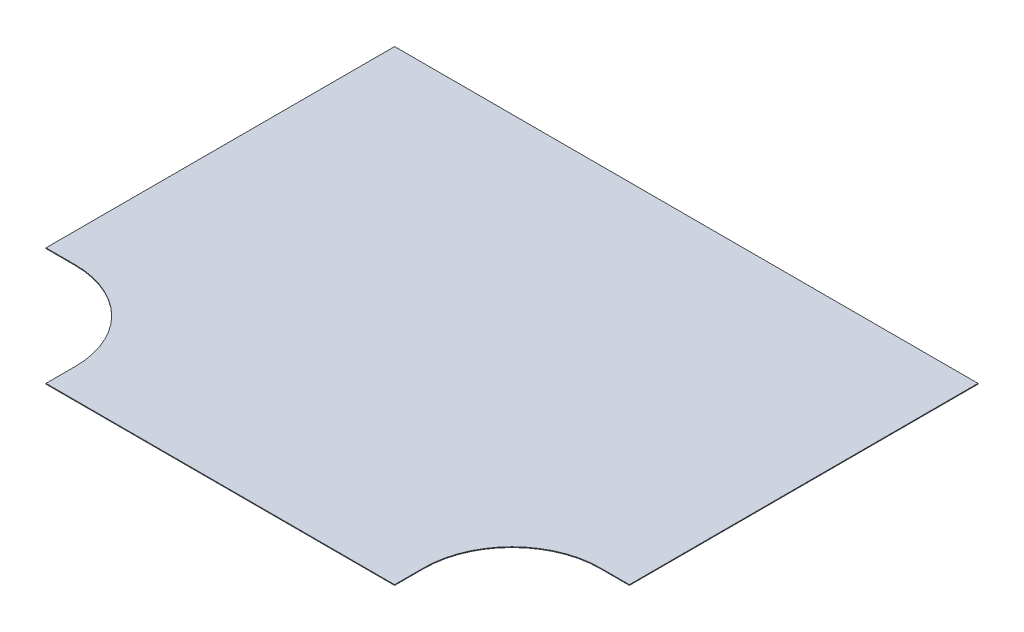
ISO-10303-21;
HEADER;
FILE_DESCRIPTION(('STEP AP214'),'2;1');
FILE_NAME('part.step','',(''),(''),'','','');
FILE_SCHEMA(('AUTOMOTIVE_DESIGN { 1 0 10303 214 1 1 1 1 }'));
ENDSEC;
DATA;
#1=APPLICATION_CONTEXT('core data for automotive mechanical design processes');
#2=APPLICATION_PROTOCOL_DEFINITION('international standard','automotive_design',2000,#1);
#3=PRODUCT_CONTEXT('',#1,'mechanical');
#4=PRODUCT('Part','Part','',(#3));
#5=PRODUCT_RELATED_PRODUCT_CATEGORY('part','',(#4));
#6=PRODUCT_DEFINITION_FORMATION('','',#4);
#7=PRODUCT_DEFINITION_CONTEXT('part definition',#1,'design');
#8=PRODUCT_DEFINITION('design','',#6,#7);
#9=PRODUCT_DEFINITION_SHAPE('','',#8);
#10=(LENGTH_UNIT() NAMED_UNIT(*) SI_UNIT(.MILLI.,.METRE.));
#11=(NAMED_UNIT(*) PLANE_ANGLE_UNIT() SI_UNIT($,.RADIAN.));
#12=(NAMED_UNIT(*) SI_UNIT($,.STERADIAN.) SOLID_ANGLE_UNIT());
#13=UNCERTAINTY_MEASURE_WITH_UNIT(LENGTH_MEASURE(1.E-05),#10,'distance_accuracy_value','');
#14=(GEOMETRIC_REPRESENTATION_CONTEXT(3) GLOBAL_UNCERTAINTY_ASSIGNED_CONTEXT((#13)) GLOBAL_UNIT_ASSIGNED_CONTEXT((#10,
#11,#12)) REPRESENTATION_CONTEXT('',''));
#15=CARTESIAN_POINT('',(0.,0.,0.));
#16=DIRECTION('',(0.,0.,1.));
#17=DIRECTION('',(1.,0.,0.));
#18=AXIS2_PLACEMENT_3D('',#15,#16,#17);
#19=CARTESIAN_POINT('',(0.,1.21412,0.));
#20=DIRECTION('',(0.,0.,-1.));
#21=DIRECTION('',(-1.,0.,0.));
#22=AXIS2_PLACEMENT_3D('',#19,#20,#21);
#23=PLANE('',#22);
#24=DIRECTION('',(1.,0.,0.));
#25=VECTOR('',#24,1.);
#26=CARTESIAN_POINT('',(0.,0.,0.));
#27=LINE('',#26,#25);
#28=CARTESIAN_POINT('',(0.,0.,0.));
#29=VERTEX_POINT('',#28);
#30=CARTESIAN_POINT('',(50.,0.,0.));
#31=VERTEX_POINT('',#30);
#32=EDGE_CURVE('E141',#29,#31,#27,.T.);
#33=ORIENTED_EDGE('',*,*,#32,.T.);
#34=DIRECTION('',(0.,-1.,0.));
#35=VECTOR('',#34,1.);
#36=CARTESIAN_POINT('',(50.,1.21412,0.));
#37=LINE('',#36,#35);
#38=CARTESIAN_POINT('',(50.,1.21412,0.));
#39=VERTEX_POINT('',#38);
#40=EDGE_CURVE('E11',#39,#31,#37,.T.);
#41=ORIENTED_EDGE('',*,*,#40,.F.);
#42=DIRECTION('',(1.,0.,0.));
#43=VECTOR('',#42,1.);
#44=CARTESIAN_POINT('',(0.,1.21412,0.));
#45=LINE('',#44,#43);
#46=CARTESIAN_POINT('',(0.,1.21412,0.));
#47=VERTEX_POINT('',#46);
#48=EDGE_CURVE('E159',#47,#39,#45,.T.);
#49=ORIENTED_EDGE('',*,*,#48,.F.);
#50=DIRECTION('',(0.,-1.,0.));
#51=VECTOR('',#50,1.);
#52=CARTESIAN_POINT('',(0.,1.21412,0.));
#53=LINE('',#52,#51);
#54=EDGE_CURVE('E137',#47,#29,#53,.T.);
#55=ORIENTED_EDGE('',*,*,#54,.T.);
#56=EDGE_LOOP('',(#33,#41,#49,#55));
#57=FACE_BOUND('',#56,.T.);
#58=ADVANCED_FACE('F33',(#57),#23,.F.);
#59=CARTESIAN_POINT('',(50.,1.21412,151.214));
#60=DIRECTION('',(0.,-1.,0.));
#61=DIRECTION('',(0.,0.,-1.));
#62=AXIS2_PLACEMENT_3D('',#59,#60,#61);
#63=CYLINDRICAL_SURFACE('',#62,151.214);
#64=CARTESIAN_POINT('',(50.,0.,151.214));
#65=DIRECTION('',(0.,-1.,0.));
#66=DIRECTION('',(0.,0.,-1.));
#67=AXIS2_PLACEMENT_3D('',#64,#65,#66);
#68=CIRCLE('',#67,151.214);
#69=CARTESIAN_POINT('',(201.214,0.,151.214));
#70=VERTEX_POINT('',#69);
#71=EDGE_CURVE('E144',#31,#70,#68,.T.);
#72=ORIENTED_EDGE('',*,*,#71,.T.);
#73=DIRECTION('',(0.,-1.,0.));
#74=VECTOR('',#73,1.);
#75=CARTESIAN_POINT('',(201.214,1.21412,151.214));
#76=LINE('',#75,#74);
#77=CARTESIAN_POINT('',(201.214,1.21412,151.214));
#78=VERTEX_POINT('',#77);
#79=EDGE_CURVE('E41',#78,#70,#76,.T.);
#80=ORIENTED_EDGE('',*,*,#79,.F.);
#81=CARTESIAN_POINT('',(50.,1.21412,151.214));
#82=DIRECTION('',(0.,-1.,0.));
#83=DIRECTION('',(0.,0.,-1.));
#84=AXIS2_PLACEMENT_3D('',#81,#82,#83);
#85=CIRCLE('',#84,151.214);
#86=EDGE_CURVE('E98',#39,#78,#85,.T.);
#87=ORIENTED_EDGE('',*,*,#86,.F.);
#88=ORIENTED_EDGE('',*,*,#40,.T.);
#89=EDGE_LOOP('',(#72,#80,#87,#88));
#90=FACE_BOUND('',#89,.T.);
#91=ADVANCED_FACE('F208',(#90),#63,.F.);
#92=CARTESIAN_POINT('',(201.214,1.21412,201.214));
#93=DIRECTION('',(1.,0.,0.));
#94=DIRECTION('',(0.,0.,-1.));
#95=AXIS2_PLACEMENT_3D('',#92,#93,#94);
#96=PLANE('',#95);
#97=DIRECTION('',(0.,0.,1.));
#98=VECTOR('',#97,1.);
#99=CARTESIAN_POINT('',(201.214,0.,201.214));
#100=LINE('',#99,#98);
#101=CARTESIAN_POINT('',(201.214,0.,201.214));
#102=VERTEX_POINT('',#101);
#103=EDGE_CURVE('E146',#70,#102,#100,.T.);
#104=ORIENTED_EDGE('',*,*,#103,.T.);
#105=DIRECTION('',(0.,-1.,0.));
#106=VECTOR('',#105,1.);
#107=CARTESIAN_POINT('',(201.214,1.21412,201.214));
#108=LINE('',#107,#106);
#109=CARTESIAN_POINT('',(201.214,1.21412,201.214));
#110=VERTEX_POINT('',#109);
#111=EDGE_CURVE('E172',#110,#102,#108,.T.);
#112=ORIENTED_EDGE('',*,*,#111,.F.);
#113=DIRECTION('',(0.,0.,1.));
#114=VECTOR('',#113,1.);
#115=CARTESIAN_POINT('',(201.214,1.21412,201.214));
#116=LINE('',#115,#114);
#117=EDGE_CURVE('E180',#78,#110,#116,.T.);
#118=ORIENTED_EDGE('',*,*,#117,.F.);
#119=ORIENTED_EDGE('',*,*,#79,.T.);
#120=EDGE_LOOP('',(#104,#112,#118,#119));
#121=FACE_BOUND('',#120,.T.);
#122=ADVANCED_FACE('F178',(#121),#96,.F.);
#123=CARTESIAN_POINT('',(201.214,1.21412,201.214));
#124=DIRECTION('',(0.,0.,-1.));
#125=DIRECTION('',(-1.,0.,0.));
#126=AXIS2_PLACEMENT_3D('',#123,#124,#125);
#127=PLANE('',#126);
#128=DIRECTION('',(1.,0.,0.));
#129=VECTOR('',#128,1.);
#130=CARTESIAN_POINT('',(201.214,0.,201.214));
#131=LINE('',#130,#129);
#132=CARTESIAN_POINT('',(798.786,0.,201.214));
#133=VERTEX_POINT('',#132);
#134=EDGE_CURVE('E148',#102,#133,#131,.T.);
#135=ORIENTED_EDGE('',*,*,#134,.T.);
#136=DIRECTION('',(0.,-1.,0.));
#137=VECTOR('',#136,1.);
#138=CARTESIAN_POINT('',(798.786,1.21412,201.214));
#139=LINE('',#138,#137);
#140=CARTESIAN_POINT('',(798.786,1.21412,201.214));
#141=VERTEX_POINT('',#140);
#142=EDGE_CURVE('E169',#141,#133,#139,.T.);
#143=ORIENTED_EDGE('',*,*,#142,.F.);
#144=DIRECTION('',(1.,0.,0.));
#145=VECTOR('',#144,1.);
#146=CARTESIAN_POINT('',(201.214,1.21412,201.214));
#147=LINE('',#146,#145);
#148=EDGE_CURVE('E198',#110,#141,#147,.T.);
#149=ORIENTED_EDGE('',*,*,#148,.F.);
#150=ORIENTED_EDGE('',*,*,#111,.T.);
#151=EDGE_LOOP('',(#135,#143,#149,#150));
#152=FACE_BOUND('',#151,.T.);
#153=ADVANCED_FACE('F189',(#152),#127,.F.);
#154=CARTESIAN_POINT('',(798.786,1.21412,201.214));
#155=DIRECTION('',(-1.,0.,0.));
#156=DIRECTION('',(0.,0.,1.));
#157=AXIS2_PLACEMENT_3D('',#154,#155,#156);
#158=PLANE('',#157);
#159=DIRECTION('',(0.,0.,-1.));
#160=VECTOR('',#159,1.);
#161=CARTESIAN_POINT('',(798.786,0.,201.214));
#162=LINE('',#161,#160);
#163=CARTESIAN_POINT('',(798.786,0.,151.214));
#164=VERTEX_POINT('',#163);
#165=EDGE_CURVE('E150',#133,#164,#162,.T.);
#166=ORIENTED_EDGE('',*,*,#165,.T.);
#167=DIRECTION('',(0.,-1.,0.));
#168=VECTOR('',#167,1.);
#169=CARTESIAN_POINT('',(798.786,1.21412,151.214));
#170=LINE('',#169,#168);
#171=CARTESIAN_POINT('',(798.786,1.21412,151.214));
#172=VERTEX_POINT('',#171);
#173=EDGE_CURVE('E166',#172,#164,#170,.T.);
#174=ORIENTED_EDGE('',*,*,#173,.F.);
#175=DIRECTION('',(0.,0.,-1.));
#176=VECTOR('',#175,1.);
#177=CARTESIAN_POINT('',(798.786,1.21412,201.214));
#178=LINE('',#177,#176);
#179=EDGE_CURVE('E195',#141,#172,#178,.T.);
#180=ORIENTED_EDGE('',*,*,#179,.F.);
#181=ORIENTED_EDGE('',*,*,#142,.T.);
#182=EDGE_LOOP('',(#166,#174,#180,#181));
#183=FACE_BOUND('',#182,.T.);
#184=ADVANCED_FACE('F193',(#183),#158,.F.);
#185=CARTESIAN_POINT('',(950.,1.21412,151.214));
#186=DIRECTION('',(0.,-1.,0.));
#187=DIRECTION('',(0.,0.,-1.));
#188=AXIS2_PLACEMENT_3D('',#185,#186,#187);
#189=CYLINDRICAL_SURFACE('',#188,151.214);
#190=CARTESIAN_POINT('',(950.,0.,151.214));
#191=DIRECTION('',(0.,-1.,0.));
#192=DIRECTION('',(0.,0.,1.));
#193=AXIS2_PLACEMENT_3D('',#190,#191,#192);
#194=CIRCLE('',#193,151.214);
#195=CARTESIAN_POINT('',(950.,0.,-1.10218211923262E-13));
#196=VERTEX_POINT('',#195);
#197=EDGE_CURVE('E152',#164,#196,#194,.T.);
#198=ORIENTED_EDGE('',*,*,#197,.T.);
#199=DIRECTION('',(0.,-1.,0.));
#200=VECTOR('',#199,1.);
#201=CARTESIAN_POINT('',(950.,1.21412,-1.10218211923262E-13));
#202=LINE('',#201,#200);
#203=CARTESIAN_POINT('',(950.,1.21412,-1.10218211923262E-13));
#204=VERTEX_POINT('',#203);
#205=EDGE_CURVE('E163',#204,#196,#202,.T.);
#206=ORIENTED_EDGE('',*,*,#205,.F.);
#207=CARTESIAN_POINT('',(950.,1.21412,151.214));
#208=DIRECTION('',(0.,-1.,0.));
#209=DIRECTION('',(0.,0.,1.));
#210=AXIS2_PLACEMENT_3D('',#207,#208,#209);
#211=CIRCLE('',#210,151.214);
#212=EDGE_CURVE('E197',#172,#204,#211,.T.);
#213=ORIENTED_EDGE('',*,*,#212,.F.);
#214=ORIENTED_EDGE('',*,*,#173,.T.);
#215=EDGE_LOOP('',(#198,#206,#213,#214));
#216=FACE_BOUND('',#215,.T.);
#217=ADVANCED_FACE('F220',(#216),#189,.F.);
#218=CARTESIAN_POINT('',(1000.,1.21412,-1.22464679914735E-13));
#219=DIRECTION('',(0.,0.,-1.));
#220=DIRECTION('',(-1.,0.,0.));
#221=AXIS2_PLACEMENT_3D('',#218,#219,#220);
#222=PLANE('',#221);
#223=DIRECTION('',(1.,0.,0.));
#224=VECTOR('',#223,1.);
#225=CARTESIAN_POINT('',(1000.,0.,-1.22464679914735E-13));
#226=LINE('',#225,#224);
#227=CARTESIAN_POINT('',(1000.,0.,-1.22464679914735E-13));
#228=VERTEX_POINT('',#227);
#229=EDGE_CURVE('E154',#196,#228,#226,.T.);
#230=ORIENTED_EDGE('',*,*,#229,.T.);
#231=DIRECTION('',(0.,-1.,0.));
#232=VECTOR('',#231,1.);
#233=CARTESIAN_POINT('',(1000.,1.21412,-1.22464679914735E-13));
#234=LINE('',#233,#232);
#235=CARTESIAN_POINT('',(1000.,1.21412,-1.22464679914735E-13));
#236=VERTEX_POINT('',#235);
#237=EDGE_CURVE('E132',#236,#228,#234,.T.);
#238=ORIENTED_EDGE('',*,*,#237,.F.);
#239=DIRECTION('',(1.,0.,0.));
#240=VECTOR('',#239,1.);
#241=CARTESIAN_POINT('',(1000.,1.21412,-1.22464679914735E-13));
#242=LINE('',#241,#240);
#243=EDGE_CURVE('E123',#204,#236,#242,.T.);
#244=ORIENTED_EDGE('',*,*,#243,.F.);
#245=ORIENTED_EDGE('',*,*,#205,.T.);
#246=EDGE_LOOP('',(#230,#238,#244,#245));
#247=FACE_BOUND('',#246,.T.);
#248=ADVANCED_FACE('F223',(#247),#222,.F.);
#249=CARTESIAN_POINT('',(1000.,1.21412,-597.572));
#250=DIRECTION('',(-1.,0.,0.));
#251=DIRECTION('',(0.,0.,1.));
#252=AXIS2_PLACEMENT_3D('',#249,#250,#251);
#253=PLANE('',#252);
#254=DIRECTION('',(0.,0.,-1.));
#255=VECTOR('',#254,1.);
#256=CARTESIAN_POINT('',(1000.,0.,-597.572));
#257=LINE('',#256,#255);
#258=CARTESIAN_POINT('',(1000.,0.,-597.572));
#259=VERTEX_POINT('',#258);
#260=EDGE_CURVE('E131',#228,#259,#257,.T.);
#261=ORIENTED_EDGE('',*,*,#260,.T.);
#262=DIRECTION('',(0.,-1.,0.));
#263=VECTOR('',#262,1.);
#264=CARTESIAN_POINT('',(1000.,1.21412,-597.572));
#265=LINE('',#264,#263);
#266=CARTESIAN_POINT('',(1000.,1.21412,-597.572));
#267=VERTEX_POINT('',#266);
#268=EDGE_CURVE('E128',#267,#259,#265,.T.);
#269=ORIENTED_EDGE('',*,*,#268,.F.);
#270=DIRECTION('',(0.,0.,-1.));
#271=VECTOR('',#270,1.);
#272=CARTESIAN_POINT('',(1000.,1.21412,-597.572));
#273=LINE('',#272,#271);
#274=EDGE_CURVE('E117',#236,#267,#273,.T.);
#275=ORIENTED_EDGE('',*,*,#274,.F.);
#276=ORIENTED_EDGE('',*,*,#237,.T.);
#277=EDGE_LOOP('',(#261,#269,#275,#276));
#278=FACE_BOUND('',#277,.T.);
#279=ADVANCED_FACE('F129',(#278),#253,.F.);
#280=CARTESIAN_POINT('',(0.,1.21412,-597.572));
#281=DIRECTION('',(0.,0.,1.));
#282=DIRECTION('',(1.,0.,0.));
#283=AXIS2_PLACEMENT_3D('',#280,#281,#282);
#284=PLANE('',#283);
#285=DIRECTION('',(-1.,0.,0.));
#286=VECTOR('',#285,1.);
#287=CARTESIAN_POINT('',(0.,0.,-597.572));
#288=LINE('',#287,#286);
#289=CARTESIAN_POINT('',(0.,0.,-597.572));
#290=VERTEX_POINT('',#289);
#291=EDGE_CURVE('E84',#259,#290,#288,.T.);
#292=ORIENTED_EDGE('',*,*,#291,.T.);
#293=DIRECTION('',(0.,-1.,0.));
#294=VECTOR('',#293,1.);
#295=CARTESIAN_POINT('',(0.,1.21412,-597.572));
#296=LINE('',#295,#294);
#297=CARTESIAN_POINT('',(0.,1.21412,-597.572));
#298=VERTEX_POINT('',#297);
#299=EDGE_CURVE('E133',#298,#290,#296,.T.);
#300=ORIENTED_EDGE('',*,*,#299,.F.);
#301=DIRECTION('',(-1.,0.,0.));
#302=VECTOR('',#301,1.);
#303=CARTESIAN_POINT('',(0.,1.21412,-597.572));
#304=LINE('',#303,#302);
#305=EDGE_CURVE('E121',#267,#298,#304,.T.);
#306=ORIENTED_EDGE('',*,*,#305,.F.);
#307=ORIENTED_EDGE('',*,*,#268,.T.);
#308=EDGE_LOOP('',(#292,#300,#306,#307));
#309=FACE_BOUND('',#308,.T.);
#310=ADVANCED_FACE('F135',(#309),#284,.F.);
#311=CARTESIAN_POINT('',(0.,1.21412,0.));
#312=DIRECTION('',(1.,0.,0.));
#313=DIRECTION('',(0.,0.,-1.));
#314=AXIS2_PLACEMENT_3D('',#311,#312,#313);
#315=PLANE('',#314);
#316=DIRECTION('',(0.,0.,1.));
#317=VECTOR('',#316,1.);
#318=CARTESIAN_POINT('',(0.,0.,0.));
#319=LINE('',#318,#317);
#320=EDGE_CURVE('E90',#290,#29,#319,.T.);
#321=ORIENTED_EDGE('',*,*,#320,.T.);
#322=ORIENTED_EDGE('',*,*,#54,.F.);
#323=DIRECTION('',(0.,0.,1.));
#324=VECTOR('',#323,1.);
#325=CARTESIAN_POINT('',(0.,1.21412,0.));
#326=LINE('',#325,#324);
#327=EDGE_CURVE('E49',#298,#47,#326,.T.);
#328=ORIENTED_EDGE('',*,*,#327,.F.);
#329=ORIENTED_EDGE('',*,*,#299,.T.);
#330=EDGE_LOOP('',(#321,#322,#328,#329));
#331=FACE_BOUND('',#330,.T.);
#332=ADVANCED_FACE('F232',(#331),#315,.F.);
#333=CARTESIAN_POINT('',(50.,1.21412,151.214));
#334=DIRECTION('',(0.,-1.,0.));
#335=DIRECTION('',(0.,0.,-1.));
#336=AXIS2_PLACEMENT_3D('',#333,#334,#335);
#337=PLANE('',#336);
#338=ORIENTED_EDGE('',*,*,#48,.T.);
#339=ORIENTED_EDGE('',*,*,#86,.T.);
#340=ORIENTED_EDGE('',*,*,#117,.T.);
#341=ORIENTED_EDGE('',*,*,#148,.T.);
#342=ORIENTED_EDGE('',*,*,#179,.T.);
#343=ORIENTED_EDGE('',*,*,#212,.T.);
#344=ORIENTED_EDGE('',*,*,#243,.T.);
#345=ORIENTED_EDGE('',*,*,#274,.T.);
#346=ORIENTED_EDGE('',*,*,#305,.T.);
#347=ORIENTED_EDGE('',*,*,#327,.T.);
#348=EDGE_LOOP('',(#338,#339,#340,#341,#342,#343,#344,#345,#346,#347));
#349=FACE_BOUND('',#348,.T.);
#350=ADVANCED_FACE('F119',(#349),#337,.F.);
#351=CARTESIAN_POINT('',(50.,0.,151.214));
#352=DIRECTION('',(0.,-1.,0.));
#353=DIRECTION('',(0.,0.,-1.));
#354=AXIS2_PLACEMENT_3D('',#351,#352,#353);
#355=PLANE('',#354);
#356=ORIENTED_EDGE('',*,*,#32,.F.);
#357=ORIENTED_EDGE('',*,*,#320,.F.);
#358=ORIENTED_EDGE('',*,*,#291,.F.);
#359=ORIENTED_EDGE('',*,*,#260,.F.);
#360=ORIENTED_EDGE('',*,*,#229,.F.);
#361=ORIENTED_EDGE('',*,*,#197,.F.);
#362=ORIENTED_EDGE('',*,*,#165,.F.);
#363=ORIENTED_EDGE('',*,*,#134,.F.);
#364=ORIENTED_EDGE('',*,*,#103,.F.);
#365=ORIENTED_EDGE('',*,*,#71,.F.);
#366=EDGE_LOOP('',(#356,#357,#358,#359,#360,#361,#362,#363,#364,#365));
#367=FACE_BOUND('',#366,.T.);
#368=ADVANCED_FACE('F184',(#367),#355,.T.);
#369=CLOSED_SHELL('',(#58,#91,#122,#153,#184,#217,#248,#279,#310,#332,#350,#368));
#370=MANIFOLD_SOLID_BREP('B2',#369);
#371=ADVANCED_BREP_SHAPE_REPRESENTATION('',(#18,#370),#14);
#372=SHAPE_DEFINITION_REPRESENTATION(#9,#371);
ENDSEC;
END-ISO-10303-21;
